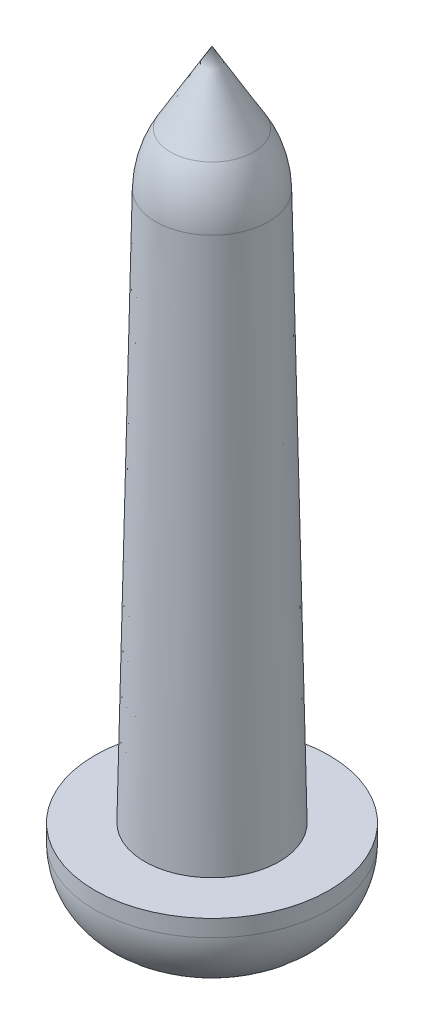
from build123d import *

# Parameters (mm, degrees)
ENL_V_MAT_EXTRU_1_DEPTH = 1
ENL_V_MAT_EXTRU_1_DRAFT = -12


with BuildPart() as part:
    # Esquisse1 → Base-R_volution (revolve)
    with BuildSketch(Plane.XY, mode=Mode.PRIVATE) as base_r_volution_sk:
        with BuildLine():
            Line((0, 0), (0.740011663, 8.631e-06))
            ThreePointArc((0.740011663, 8.631e-06), (1.447110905, 0.292905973), (1.74, 1.000008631))
            Line((1.74, 1.000008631), (1.74, 1.25))
            Line((1.74, 1.25), (1, 1.25))
            Line((1, 1.25), (0.837885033, 9.406047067))
            ThreePointArc((0.837885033, 9.406047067), (0.777598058, 9.813417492), (0.616844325, 10.192552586))
            Line((0.616844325, 10.192552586), (0, 11.25))
            Line((0, 11.25), (0, 0))
        make_face()
    revolve(base_r_volution_sk.sketch.rotate(Axis((0, 0, 0), (0, 1, 0)), 90), axis=Axis((0, 0, 0), (0, 1, 0)))


with BuildPart() as enl_v_mat_extru_1_tool:
    # Esquisse2 → Enl_v. mat.-Extru.1 (with draft: the straight prism first)
    with BuildSketch(Plane.XZ):
        with BuildLine():
            Line((0.35, -1.5), (0.35, -0.55))
            ThreePointArc((0.35, -0.55), (0.408578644, -0.408578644), (0.55, -0.35))
            Line((0.55, -0.35), (1.5, -0.35))
            Line((1.5, -0.35), (1.5, 0.35))
            Line((1.5, 0.35), (0.55, 0.35))
            ThreePointArc((0.55, 0.35), (0.408578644, 0.408578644), (0.35, 0.55))
            Line((0.35, 0.55), (0.35, 1.5))
            Line((0.35, 1.5), (-0.35, 1.5))
            Line((-0.35, 1.5), (-0.35, 0.55))
            ThreePointArc((-0.35, 0.55), (-0.408578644, 0.408578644), (-0.55, 0.35))
            Line((-0.55, 0.35), (-1.5, 0.35))
            Line((-1.5, 0.35), (-1.5, -0.35))
            Line((-1.5, -0.35), (-0.55, -0.35))
            ThreePointArc((-0.55, -0.35), (-0.408578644, -0.408578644), (-0.35, -0.55))
            Line((-0.35, -0.55), (-0.35, -1.5))
            Line((-0.35, -1.5), (0.35, -1.5))
        make_face()
    extrude(amount=-ENL_V_MAT_EXTRU_1_DEPTH)
    # Enl_v. mat.-Extru.1: the draft: its side faces are tilted about the plane it starts from
    enl_v_mat_extru_1_sides = [enl_v_mat_extru_1_tool.faces().sort_by_distance(p)[0] for p in [
        (-0.35, 0.5, -1.025),
        (0, 0.5, -1.5),
        (0.35, 0.5, -1.025),
        (0.408578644, 0.5, -0.408578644),
        (1.025, 0.5, -0.35),
        (1.5, 0.5, 0),
        (1.025, 0.5, 0.35),
        (0.408578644, 0.5, 0.408578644),
        (0.35, 0.5, 1.025),
        (0, 0.5, 1.5),
        (-0.35, 0.5, 1.025),
        (-0.408578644, 0.5, 0.408578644),
        (-1.025, 0.5, 0.35),
        (-1.5, 0.5, 0),
        (-1.025, 0.5, -0.35),
        (-0.408578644, 0.5, -0.408578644),
    ]]
    draft(enl_v_mat_extru_1_sides, Plane.XZ, ENL_V_MAT_EXTRU_1_DRAFT)


with BuildPart() as part_1:
    add(part.part)

    # Enl_v. mat.-Extru.1: cut by enl_v_mat_extru_1_tool
    add(enl_v_mat_extru_1_tool.part, mode=Mode.SUBTRACT)


solid = part_1.part
